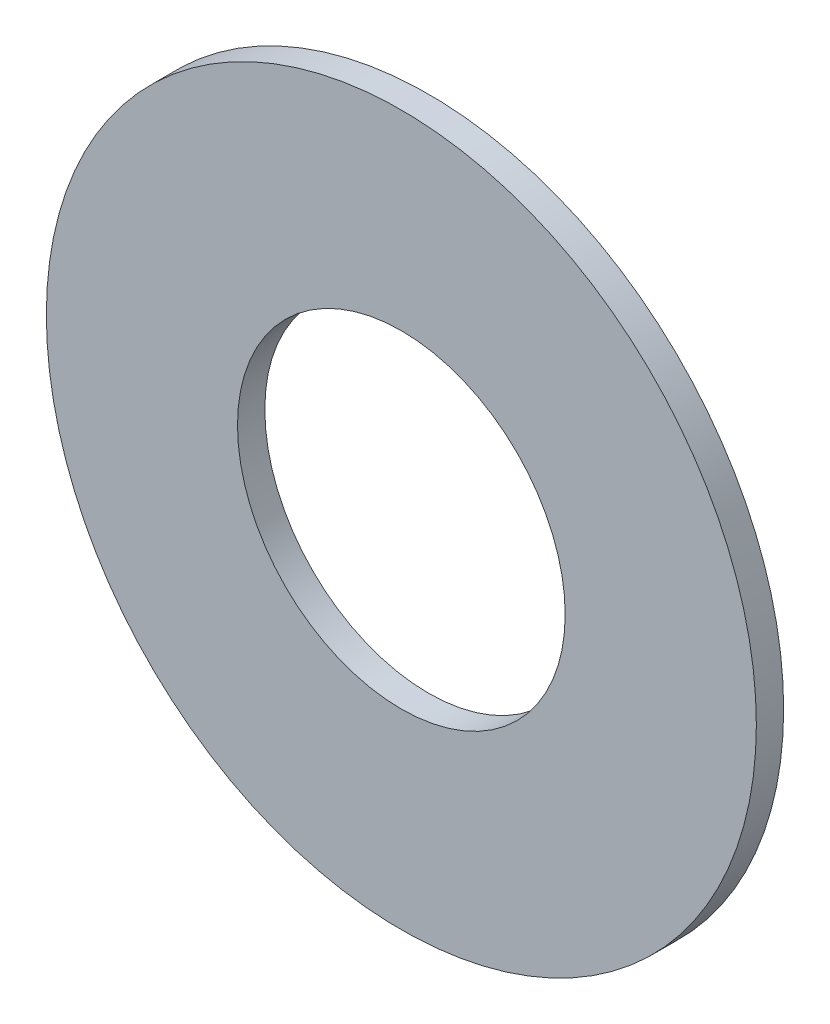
ISO-10303-21;
HEADER;
FILE_DESCRIPTION(('STEP AP214'),'2;1');
FILE_NAME('part.step','',(''),(''),'','','');
FILE_SCHEMA(('AUTOMOTIVE_DESIGN { 1 0 10303 214 1 1 1 1 }'));
ENDSEC;
DATA;
#1=APPLICATION_CONTEXT('core data for automotive mechanical design processes');
#2=APPLICATION_PROTOCOL_DEFINITION('international standard','automotive_design',2000,#1);
#3=PRODUCT_CONTEXT('',#1,'mechanical');
#4=PRODUCT('Part','Part','',(#3));
#5=PRODUCT_RELATED_PRODUCT_CATEGORY('part','',(#4));
#6=PRODUCT_DEFINITION_FORMATION('','',#4);
#7=PRODUCT_DEFINITION_CONTEXT('part definition',#1,'design');
#8=PRODUCT_DEFINITION('design','',#6,#7);
#9=PRODUCT_DEFINITION_SHAPE('','',#8);
#10=(LENGTH_UNIT() NAMED_UNIT(*) SI_UNIT(.MILLI.,.METRE.));
#11=(NAMED_UNIT(*) PLANE_ANGLE_UNIT() SI_UNIT($,.RADIAN.));
#12=(NAMED_UNIT(*) SI_UNIT($,.STERADIAN.) SOLID_ANGLE_UNIT());
#13=UNCERTAINTY_MEASURE_WITH_UNIT(LENGTH_MEASURE(1.E-05),#10,'distance_accuracy_value','');
#14=(GEOMETRIC_REPRESENTATION_CONTEXT(3) GLOBAL_UNCERTAINTY_ASSIGNED_CONTEXT((#13)) GLOBAL_UNIT_ASSIGNED_CONTEXT((#10,
#11,#12)) REPRESENTATION_CONTEXT('',''));
#15=CARTESIAN_POINT('',(0.,0.,0.));
#16=DIRECTION('',(0.,0.,1.));
#17=DIRECTION('',(1.,0.,0.));
#18=AXIS2_PLACEMENT_3D('',#15,#16,#17);
#19=CARTESIAN_POINT('',(0.,0.,0.5));
#20=DIRECTION('',(0.,0.,1.));
#21=DIRECTION('',(1.,0.,0.));
#22=AXIS2_PLACEMENT_3D('',#19,#20,#21);
#23=PLANE('',#22);
#24=CARTESIAN_POINT('',(0.,0.,0.5));
#25=DIRECTION('',(0.,0.,1.));
#26=DIRECTION('',(1.,0.,0.));
#27=AXIS2_PLACEMENT_3D('',#24,#25,#26);
#28=CIRCLE('',#27,6.5);
#29=CARTESIAN_POINT('',(6.5,0.,0.5));
#30=VERTEX_POINT('',#29);
#31=EDGE_CURVE('E10',#30,#30,#28,.T.);
#32=ORIENTED_EDGE('',*,*,#31,.T.);
#33=EDGE_LOOP('',(#32));
#34=FACE_BOUND('',#33,.T.);
#35=CARTESIAN_POINT('',(0.,0.,0.5));
#36=DIRECTION('',(0.,0.,1.));
#37=DIRECTION('',(1.,0.,0.));
#38=AXIS2_PLACEMENT_3D('',#35,#36,#37);
#39=CIRCLE('',#38,3.);
#40=CARTESIAN_POINT('',(3.,0.,0.5));
#41=VERTEX_POINT('',#40);
#42=EDGE_CURVE('E39',#41,#41,#39,.T.);
#43=ORIENTED_EDGE('',*,*,#42,.F.);
#44=EDGE_LOOP('',(#43));
#45=FACE_BOUND('',#44,.T.);
#46=ADVANCED_FACE('F28',(#34,#45),#23,.T.);
#47=CARTESIAN_POINT('',(0.,0.,0.));
#48=DIRECTION('',(0.,0.,1.));
#49=DIRECTION('',(1.,0.,0.));
#50=AXIS2_PLACEMENT_3D('',#47,#48,#49);
#51=PLANE('',#50);
#52=CARTESIAN_POINT('',(0.,0.,0.));
#53=DIRECTION('',(0.,0.,1.));
#54=DIRECTION('',(1.,0.,0.));
#55=AXIS2_PLACEMENT_3D('',#52,#53,#54);
#56=CIRCLE('',#55,6.5);
#57=CARTESIAN_POINT('',(6.5,0.,0.));
#58=VERTEX_POINT('',#57);
#59=EDGE_CURVE('E35',#58,#58,#56,.T.);
#60=ORIENTED_EDGE('',*,*,#59,.F.);
#61=EDGE_LOOP('',(#60));
#62=FACE_BOUND('',#61,.T.);
#63=CARTESIAN_POINT('',(0.,0.,0.));
#64=DIRECTION('',(0.,0.,1.));
#65=DIRECTION('',(1.,0.,0.));
#66=AXIS2_PLACEMENT_3D('',#63,#64,#65);
#67=CIRCLE('',#66,3.);
#68=CARTESIAN_POINT('',(3.,0.,0.));
#69=VERTEX_POINT('',#68);
#70=EDGE_CURVE('E43',#69,#69,#67,.T.);
#71=ORIENTED_EDGE('',*,*,#70,.T.);
#72=EDGE_LOOP('',(#71));
#73=FACE_BOUND('',#72,.T.);
#74=ADVANCED_FACE('F49',(#62,#73),#51,.F.);
#75=CARTESIAN_POINT('',(0.,0.,0.5));
#76=DIRECTION('',(0.,0.,-1.));
#77=DIRECTION('',(-1.,0.,0.));
#78=AXIS2_PLACEMENT_3D('',#75,#76,#77);
#79=CYLINDRICAL_SURFACE('',#78,6.5);
#80=ORIENTED_EDGE('',*,*,#31,.F.);
#81=EDGE_LOOP('',(#80));
#82=FACE_BOUND('',#81,.T.);
#83=ORIENTED_EDGE('',*,*,#59,.T.);
#84=EDGE_LOOP('',(#83));
#85=FACE_BOUND('',#84,.T.);
#86=ADVANCED_FACE('F30',(#82,#85),#79,.T.);
#87=CARTESIAN_POINT('',(0.,0.,0.5));
#88=DIRECTION('',(0.,0.,-1.));
#89=DIRECTION('',(-1.,0.,0.));
#90=AXIS2_PLACEMENT_3D('',#87,#88,#89);
#91=CYLINDRICAL_SURFACE('',#90,3.);
#92=ORIENTED_EDGE('',*,*,#42,.T.);
#93=EDGE_LOOP('',(#92));
#94=FACE_BOUND('',#93,.T.);
#95=ORIENTED_EDGE('',*,*,#70,.F.);
#96=EDGE_LOOP('',(#95));
#97=FACE_BOUND('',#96,.T.);
#98=ADVANCED_FACE('F51',(#94,#97),#91,.F.);
#99=CLOSED_SHELL('',(#46,#74,#86,#98));
#100=MANIFOLD_SOLID_BREP('B2',#99);
#101=ADVANCED_BREP_SHAPE_REPRESENTATION('',(#18,#100),#14);
#102=SHAPE_DEFINITION_REPRESENTATION(#9,#101);
ENDSEC;
END-ISO-10303-21;
